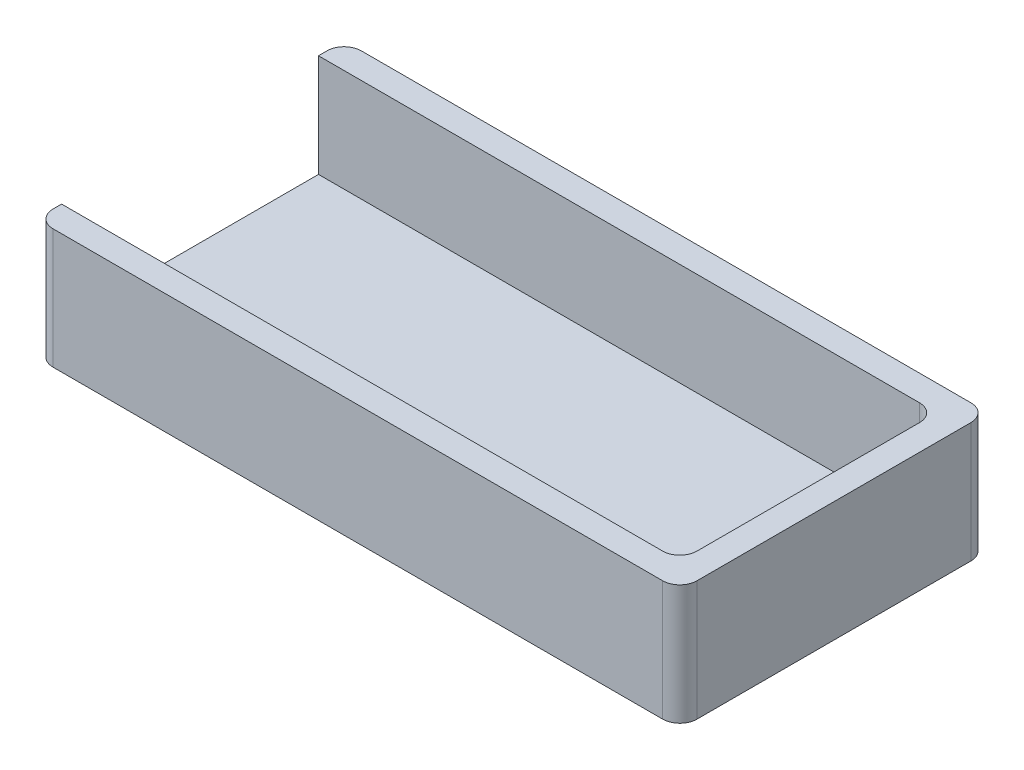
from build123d import *

# Parameters (mm, degrees)
CROQUIS1_W              = 37.6
CROQUIS1_H              = 18
SALIENTE_EXTRUIR1_DEPTH = 1
SALIENTE_EXTRUIR2_DEPTH = 6
REDONDEO8_R             = 1


with BuildPart() as part:
    # Croquis1 → Saliente-Extruir1 (new body)
    with BuildSketch(Plane(origin=(0, 0, 0), x_dir=(1, 0, 0), z_dir=(0, 1, 0))):
        with Locations((18.8, 9)):
            Rectangle(CROQUIS1_W, CROQUIS1_H)
    extrude(amount=SALIENTE_EXTRUIR1_DEPTH)

    # Croquis2 → Saliente-Extruir2 (add)
    with BuildSketch(Plane(origin=(0, 1, 0), x_dir=(1, 0, 0), z_dir=(0, 1, 0))):
        Polygon((0, 18), (37.6, 18), (37.6, 0), (0, 0), (0, 1.5), (36.1, 1.5), (36.1, 16.5), (0, 16.5), align=None)
    extrude(amount=SALIENTE_EXTRUIR2_DEPTH)

    # Redondeo8
    redondeo8_edges = [part.edges().sort_by_distance(p)[0] for p in [
        (36.1, 4, -16.5),
        (36.1, 4, -1.5),
        (37.6, 3.5, -18),
        (37.6, 3.5, 0),
        (0, 3.5, 0),
        (0, 3.5, -18),
    ]]
    fillet(redondeo8_edges, radius=REDONDEO8_R)


solid = part.part
